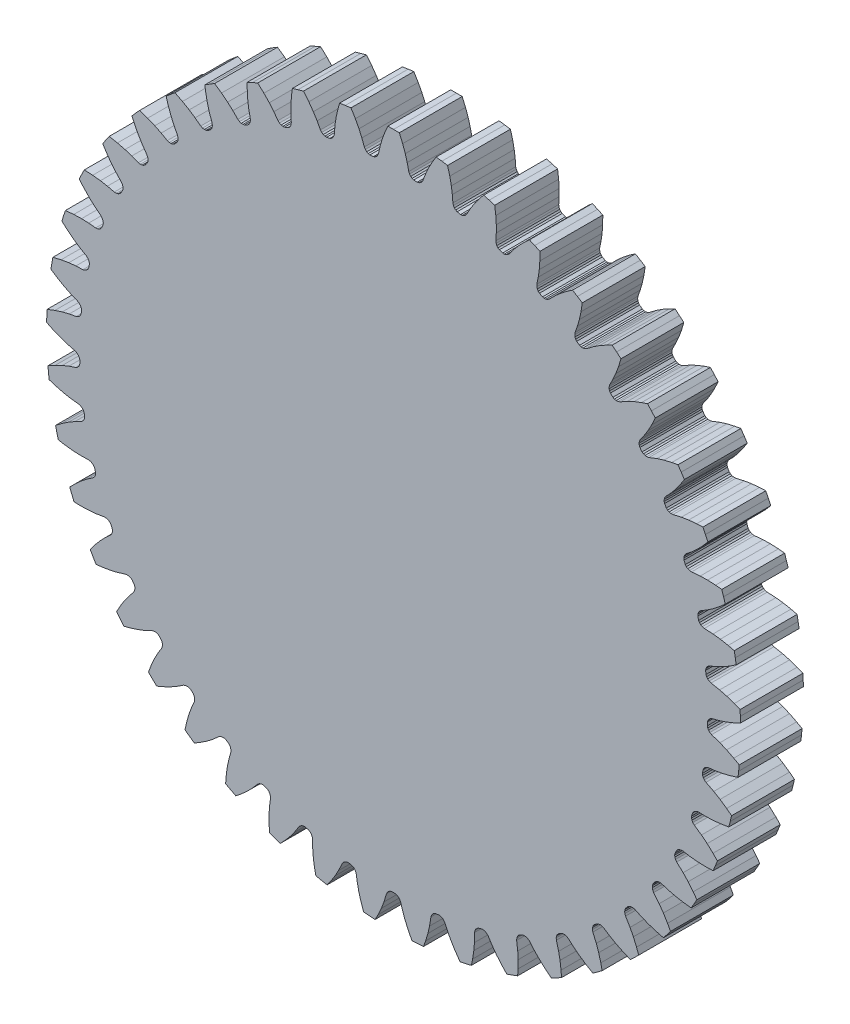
from build123d import *

# Parameters (mm, degrees)
LINEAR_AUSTRAGEN1_DEPTH = 1


with BuildPart() as part:
    # Skizze1 → Linear austragen1 (new body)
    with BuildSketch(Plane.XY):
        Polygon((1.147672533, -5.399374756), (1.058015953, -5.417656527), (0.980703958, -5.308110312), (0.915703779, -5.202894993), (0.862745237, -5.102938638), (0.815981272, -5.000425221), (0.796830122, -4.974771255), (0.774719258, -4.956898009), (0.748999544, -4.945714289), (0.722397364, -4.942161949), (0.667831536, -4.949830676), (0.643239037, -4.960577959), (0.621598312, -4.978417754), (0.604769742, -5.002652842), (0.593531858, -5.033229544), (0.572271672, -5.170171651), (0.546225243, -5.283717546), (0.509782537, -5.405605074), (0.47627831, -5.499414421), (0.385055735, -5.506553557), (0.293727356, -5.512179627), (0.232413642, -5.392939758), (0.182689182, -5.279702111), (0.144157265, -5.17334812), (0.112115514, -5.06532407), (0.096721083, -5.037254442), (0.077312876, -5.0164779), (0.053399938, -5.001823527), (0.027551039, -4.99460345), (-0.027551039, -4.99460345), (-0.053399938, -5.001823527), (-0.077312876, -5.0164779), (-0.097350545, -5.038135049), (-0.112734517, -5.066850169), (-0.152846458, -5.199500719), (-0.194441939, -5.308316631), (-0.247493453, -5.423946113), (-0.293727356, -5.512179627), (-0.385055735, -5.506553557), (-0.47627831, -5.499414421), (-0.520400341, -5.372801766), (-0.553881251, -5.253745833), (-0.577236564, -5.143064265), (-0.593932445, -5.031632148), (-0.605270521, -5.001693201), (-0.621598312, -4.978417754), (-0.643239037, -4.960577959), (-0.667831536, -4.949830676), (-0.722397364, -4.942161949), (-0.748999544, -4.945714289), (-0.774719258, -4.956898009), (-0.797576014, -4.975555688), (-0.816806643, -5.001850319), (-0.874989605, -5.12762742), (-0.93132453, -5.229595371), (-0.999952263, -5.336716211), (-1.058015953, -5.417656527), (-1.147672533, -5.399374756), (-1.237013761, -5.379609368), (-1.263085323, -5.2480883), (-1.279671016, -5.125531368), (-1.287395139, -5.012676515), (-1.288420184, -4.90000523), (-1.295481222, -4.868779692), (-1.308410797, -4.84345837), (-1.327358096, -4.822780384), (-1.35021553, -4.808715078), (-1.403183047, -4.793526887), (-1.430020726, -4.793342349), (-1.45704661, -4.800837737), (-1.482277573, -4.816132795), (-1.504980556, -4.839495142), (-1.580102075, -4.955950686), (-1.650079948, -5.049085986), (-1.732948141, -5.145613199), (-1.801711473, -5.217684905), (-1.887951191, -5.187103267), (-1.973672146, -5.155096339), (-1.981185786, -5.021226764), (-1.980553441, -4.897554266), (-1.972496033, -4.784722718), (-1.95783029, -4.673005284), (-1.960476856, -4.641100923), (-1.969756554, -4.614226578), (-1.98564164, -4.591112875), (-2.006319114, -4.574003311), (-2.056657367, -4.551591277), (-2.083208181, -4.547673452), (-2.111014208, -4.551334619), (-2.138128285, -4.562969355), (-2.163861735, -4.582944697), (-2.254459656, -4.687812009), (-2.336718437, -4.770301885), (-2.432214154, -4.854356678), (-2.510338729, -4.916156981), (-2.591483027, -4.873870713), (-2.671915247, -4.830245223), (-2.660724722, -4.696632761), (-2.642886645, -4.574251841), (-2.619204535, -4.463639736), (-2.589133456, -4.355050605), (-2.587314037, -4.323088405), (-2.59276324, -4.295184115), (-2.605276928, -4.270084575), (-2.623371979, -4.250263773), (-2.670101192, -4.22106412), (-2.695848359, -4.213489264), (-2.723893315, -4.21324495), (-2.752362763, -4.220992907), (-2.780625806, -4.237192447), (-2.884936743, -4.328430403), (-2.97787536, -4.398669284), (-3.084139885, -4.468615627), (-3.170105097, -4.518941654), (-3.244574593, -4.465773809), (-3.318152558, -4.411378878), (-3.288475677, -4.280624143), (-3.253779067, -4.161916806), (-3.2149332, -4.055677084), (-3.170042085, -3.95232982), (-3.163792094, -3.920931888), (-3.165304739, -3.892540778), (-3.174203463, -3.865943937), (-3.189363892, -3.843797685), (-3.231574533, -3.808378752), (-3.256016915, -3.7972943), (-3.283754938, -3.79314926), (-3.313025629, -3.796859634), (-3.343268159, -3.808968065), (-3.459261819, -3.884800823), (-3.561071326, -3.941421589), (-3.676036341, -3.995898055), (-3.768168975, -4.033770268), (-3.834514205, -3.970755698), (-3.899805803, -3.906650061), (-3.852220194, -3.781298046), (-3.801340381, -3.668574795), (-3.748086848, -3.56877529), (-3.68924945, -3.47268143), (-3.678690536, -3.442458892), (-3.676237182, -3.414133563), (-3.681347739, -3.386557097), (-3.693278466, -3.362516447), (-3.730148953, -3.321567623), (-3.752810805, -3.307189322), (-3.779702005, -3.299224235), (-3.809204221, -3.298824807), (-3.8408376, -3.306606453), (-3.966256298, -3.365558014), (-4.074955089, -3.407458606), (-4.196382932, -3.445404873), (-4.292889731, -3.470086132), (-4.34981936, -3.398451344), (-4.405553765, -3.325882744), (-4.340985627, -3.208373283), (-4.274912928, -3.103828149), (-4.208288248, -3.012411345), (-4.136649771, -2.925441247), (-4.121987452, -2.896982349), (-4.115615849, -2.869274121), (-4.116838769, -2.841254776), (-4.125307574, -2.815787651), (-4.156120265, -2.770105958), (-4.176560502, -2.752713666), (-4.202081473, -2.741083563), (-4.231240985, -2.736582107), (-4.263649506, -2.739885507), (-4.396052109, -2.780808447), (-4.509524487, -2.807173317), (-4.635051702, -2.827850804), (-4.73405427, -2.838860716), (-4.780460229, -2.76), (-4.825552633, -2.680380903), (-4.745258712, -2.573001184), (-4.665279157, -2.478669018), (-4.586580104, -2.39741424), (-4.50353491, -2.321260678), (-4.48505457, -2.29511934), (-4.474888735, -2.268567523), (-4.472200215, -2.240650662), (-4.477042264, -2.214252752), (-4.501197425, -2.164727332), (-4.519018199, -2.144659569), (-4.542672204, -2.129590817), (-4.570921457, -2.121074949), (-4.603474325, -2.119835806), (-4.740283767, -2.141933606), (-4.85632112, -2.152249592), (-4.983504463, -2.155255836), (-5.083075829, -2.152380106), (-5.118054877, -2.067828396), (-5.151627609, -1.982708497), (-5.057170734, -1.887548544), (-4.964841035, -1.805265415), (-4.875599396, -1.735754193), (-4.782763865, -1.67189941), (-4.760825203, -1.648584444), (-4.747063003, -1.623705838), (-4.740515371, -1.596434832), (-4.741636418, -1.569619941), (-4.758663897, -1.517214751), (-4.773518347, -1.494862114), (-4.794844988, -1.476648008), (-4.821634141, -1.46428348), (-4.853697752, -1.458525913), (-4.992251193, -1.461368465), (-5.108594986, -1.455434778), (-5.234958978, -1.440711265), (-5.333161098, -1.424005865), (-5.356032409, -1.335408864), (-5.377432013, -1.246444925), (-5.27065068, -1.165356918), (-5.167767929, -1.096724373), (-5.069720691, -1.040309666), (-4.968901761, -0.989996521), (-4.943931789, -0.969961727), (-4.926841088, -0.947240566), (-4.916561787, -0.921146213), (-4.913940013, -0.894436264), (-4.923508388, -0.84017131), (-4.935107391, -0.815968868), (-4.953691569, -0.794963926), (-4.978499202, -0.778991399), (-5.009449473, -0.768827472), (-5.147050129, -0.752359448), (-5.261435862, -0.730291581), (-5.384520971, -0.698124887), (-5.479442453, -0.66791497), (-5.489760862, -0.576997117), (-5.498570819, -0.48592072), (-5.381543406, -0.420482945), (-5.270110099, -0.366836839), (-5.16516564, -0.324616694), (-5.058325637, -0.288824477), (-5.030810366, -0.272459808), (-5.010723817, -0.252338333), (-4.99691292, -0.227928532), (-4.990599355, -0.201843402), (-4.99252239, -0.146774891), (-5.000640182, -0.121193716), (-5.016120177, -0.097806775), (-5.038463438, -0.078537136), (-5.067697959, -0.064164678), (-5.201667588, -0.02870661), (-5.311868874, 0.009065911), (-5.429279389, 0.058049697), (-5.519072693, 0.10117613), (-5.516637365, 0.192645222), (-5.512686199, 0.284061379), (-5.387690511, 0.33257525), (-5.26987557, 0.370190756), (-5.160076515, 0.397394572), (-5.049294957, 0.417969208), (-5.019769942, 0.430345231), (-4.997078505, 0.447475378), (-4.980004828, 0.469725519), (-4.970122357, 0.494678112), (-4.964362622, 0.549478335), (-4.968841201, 0.575940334), (-4.980915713, 0.601254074), (-5.000359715, 0.623445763), (-5.027309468, 0.641747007), (-5.155040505, 0.695504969), (-5.2589124, 0.748246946), (-5.368363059, 0.81309441), (-5.451280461, 0.868297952), (-5.436138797, 0.958537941), (-5.419503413, 1.048514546), (-5.288972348, 1.079160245), (-5.167068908, 1.10001301), (-5.05455237, 1.111671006), (-4.941985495, 1.116627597), (-4.911025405, 1.124774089), (-4.886170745, 1.138579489), (-4.866166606, 1.158236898), (-4.852907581, 1.181571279), (-4.839577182, 1.23503659), (-4.840329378, 1.261864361), (-4.84876339, 1.288612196), (-4.864929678, 1.313293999), (-4.889070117, 1.335167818), (-5.008076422, 1.406179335), (-5.103597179, 1.472864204), (-5.202957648, 1.552313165), (-5.277385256, 1.618519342), (-5.24983197, 1.705773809), (-5.220836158, 1.79255957), (-5.087310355, 1.804740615), (-4.963691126, 1.808424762), (-4.850647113, 1.804310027), (-4.738485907, 1.7935521), (-4.706693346, 1.7973105), (-4.680159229, 1.807522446), (-4.657613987, 1.824204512), (-4.64123648, 1.845466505), (-4.620594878, 1.896556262), (-4.617606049, 1.923227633), (-4.622235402, 1.950888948), (-4.634809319, 1.977580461), (-4.655670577, 2.002601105), (-4.763635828, 2.08948402), (-4.848946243, 2.168813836), (-4.936282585, 2.26131791), (-5.000771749, 2.337238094), (-4.961343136, 2.41980873), (-4.920551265, 2.501714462), (-4.786629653, 2.495193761), (-4.663700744, 2.481637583), (-4.552329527, 2.461830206), (-4.44275708, 2.435567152), (-4.410750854, 2.434864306), (-4.383053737, 2.441284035), (-4.358406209, 2.454666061), (-4.339228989, 2.473441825), (-4.31167795, 2.521161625), (-4.305006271, 2.547157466), (-4.305740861, 2.575193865), (-4.314477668, 2.60337557), (-4.331653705, 2.63105604), (-4.426476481, 2.732119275), (-4.499916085, 2.822549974), (-4.573528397, 2.926308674), (-4.626823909, 3.010465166), (-4.576287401, 3.086744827), (-4.524493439, 3.162176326), (-4.392782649, 3.137080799), (-4.272936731, 3.106548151), (-4.165406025, 3.071433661), (-4.06055504, 3.030176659), (-4.028958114, 3.025026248), (-4.00063709, 3.027528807), (-3.974367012, 3.037350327), (-3.952763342, 3.053274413), (-3.918839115, 3.096695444), (-3.908614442, 3.121509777), (-3.905439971, 3.149375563), (-3.910169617, 3.178498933), (-3.923326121, 3.208300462), (-4.003160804, 3.321576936), (-4.063300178, 3.421348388), (-4.12175568, 3.534342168), (-4.162820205, 3.625096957), (-4.102159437, 3.693600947), (-4.040371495, 3.761090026), (-3.913435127, 3.717908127), (-3.799004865, 3.670993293), (-3.697407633, 3.621255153), (-3.599318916, 3.565807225), (-3.568746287, 3.556309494), (-3.540352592, 3.554846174), (-3.512971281, 3.560916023), (-3.489361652, 3.573678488), (-3.449724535, 3.611955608), (-3.43614588, 3.635105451), (-3.429124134, 3.662258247), (-3.429754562, 3.691756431), (-3.438635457, 3.723098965), (-3.501928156, 3.846383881), (-3.547596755, 3.953554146), (-3.589757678, 4.073583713), (-3.61779194, 4.169170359), (-3.548187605, 4.228565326), (-3.477608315, 4.286798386), (-3.357917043, 4.226370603), (-3.25112969, 4.163986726), (-3.157443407, 4.100593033), (-3.068026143, 4.032033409), (-3.039072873, 4.018373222), (-3.011159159, 4.012972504), (-2.983199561, 4.01517254), (-2.958043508, 4.024524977), (-2.91346499, 4.056913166), (-2.896796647, 4.077947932), (-2.886064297, 4.103859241), (-2.882583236, 4.133158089), (-2.887015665, 4.165431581), (-2.93253446, 4.296325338), (-2.962843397, 4.40880847), (-2.987889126, 4.533537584), (-3.00234747, 4.632095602), (-2.925154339, 4.681225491), (-2.847157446, 4.729069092), (-2.737040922, 4.652571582), (-2.639974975, 4.575932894), (-2.556023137, 4.500117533), (-2.47701773, 4.419780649), (-2.450247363, 4.402223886), (-2.423356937, 4.392990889), (-2.395363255, 4.391278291), (-2.369150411, 4.397038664), (-2.320498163, 4.422907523), (-2.301064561, 4.441417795), (-2.286830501, 4.465583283), (-2.279305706, 4.494112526), (-2.279203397, 4.52668881), (-2.306062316, 4.662643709), (-2.320421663, 4.778250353), (-2.32786471, 4.905251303), (-2.328465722, 5.004862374), (-2.24518627, 5.042770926), (-2.161289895, 5.079293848), (-2.062891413, 4.988215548), (-1.977436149, 4.898813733), (-1.904852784, 4.812052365), (-1.837796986, 4.721501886), (-1.813730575, 4.70039027), (-1.78838683, 4.687504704), (-1.760903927, 4.681912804), (-1.734144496, 4.683968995), (-1.68236548, 4.702815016), (-1.660544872, 4.718440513), (-1.643086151, 4.740389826), (-1.631664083, 4.767594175), (-1.627029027, 4.79983919), (-1.634705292, 4.938209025), (-1.63283556, 5.054689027), (-1.622531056, 5.181489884), (-1.609263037, 5.280215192), (-1.521518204, 5.306164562), (-1.433355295, 5.330655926), (-1.34859007, 5.226769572), (-1.276408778, 5.126344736), (-1.216606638, 5.030326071), (-1.162805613, 4.93132446), (-1.141911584, 4.907068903), (-1.118607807, 4.890781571), (-1.092170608, 4.881419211), (-1.065385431, 4.879731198), (-1.011487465, 4.891187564), (-0.987704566, 4.903624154), (-0.967360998, 4.922930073), (-0.952263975, 4.948280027), (-0.943186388, 4.97956616), (-0.93153059, 5.117657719), (-0.91346817, 5.232743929), (-0.885616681, 5.35687666), (-0.858737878, 5.452794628), (-0.768235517, 5.466279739), (-0.677522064, 5.47826285), (-0.608039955, 5.363590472), (-0.550537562, 5.254097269), (-0.504680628, 5.150690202), (-0.465181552, 5.045164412), (-0.447866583, 5.018237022), (-0.427056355, 4.998864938), (-0.40217943, 4.985914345), (-0.375889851, 4.980514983), (-0.320921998, 4.98435871), (-0.295639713, 4.993364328), (-0.272807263, 5.009651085), (-0.254329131, 5.032653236), (-0.240985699, 5.062371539), (-0.210224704, 5.197497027), (-0.176321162, 5.308949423), (-0.131464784, 5.427997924), (-0.091498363, 5.519241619), (0, 5.52), (0.091498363, 5.519241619), (0.144344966, 5.396015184), (0.186049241, 5.279584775), (0.217068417, 5.170802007), (0.241496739, 5.060805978), (0.254895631, 5.031730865), (0.272807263, 5.009651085), (0.295639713, 4.993364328), (0.320921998, 4.98435871), (0.375889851, 4.980514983), (0.40217943, 4.985914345), (0.427056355, 4.998864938), (0.448555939, 5.019071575), (0.465905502, 5.046643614), (0.515172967, 5.176172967), (0.564257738, 5.281822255), (0.625245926, 5.393469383), (0.677522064, 5.47826285), (0.768235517, 5.466279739), (0.858737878, 5.452794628), (0.893920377, 5.323412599), (0.919014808, 5.202311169), (0.934592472, 5.090270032), (0.943474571, 4.977944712), (0.952696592, 4.947287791), (0.967360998, 4.922930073), (0.987704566, 4.903624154), (1.011487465, 4.891187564), (1.065385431, 4.879731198), (1.092170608, 4.881419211), (1.118607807, 4.890781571), (1.142710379, 4.907799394), (1.163728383, 4.932688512), (1.230543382, 5.054100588), (1.293854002, 5.151890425), (1.369786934, 5.253963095), (1.433355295, 5.330655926), (1.521518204, 5.306164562), (1.609263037, 5.280215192), (1.626096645, 5.147195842), (1.634092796, 5.023780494), (1.633925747, 4.910661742), (1.627088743, 4.798193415), (1.631954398, 4.766551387), (1.643086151, 4.740389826), (1.660544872, 4.718440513), (1.68236548, 4.702815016), (1.734144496, 4.683968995), (1.760903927, 4.681912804), (1.78838683, 4.687504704), (1.81462326, 4.701002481), (1.838900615, 4.722724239), (1.92196267, 4.83365589), (1.99826687, 4.921682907), (2.087666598, 5.012194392), (2.161289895, 5.079293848), (2.24518627, 5.042770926), (2.328465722, 5.004862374), (2.32662279, 4.870794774), (2.317365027, 4.747467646), (2.301456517, 4.635473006), (2.279033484, 4.52505074), (2.279448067, 4.493039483), (2.286830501, 4.465583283), (2.301064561, 4.441417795), (2.320498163, 4.422907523), (2.369150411, 4.397038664), (2.395363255, 4.391278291), (2.423356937, 4.392990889), (2.451216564, 4.402705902), (2.478280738, 4.42083751), (2.57597314, 4.519129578), (2.663785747, 4.595680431), (2.764912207, 4.672869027), (2.847157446, 4.729069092), (2.925154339, 4.681225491), (3.00234747, 4.632095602), (2.98186387, 4.499589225), (2.955532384, 4.37875074), (2.924192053, 4.270060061), (2.88661943, 4.1638331), (2.882574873, 4.132075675), (2.886064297, 4.103859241), (2.896796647, 4.077947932), (2.91346499, 4.056913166), (2.958043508, 4.024524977), (2.983199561, 4.01517254), (3.011159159, 4.012972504), (3.040099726, 4.01871566), (3.069423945, 4.032904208), (3.179845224, 4.11664355), (3.277457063, 4.180228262), (3.388341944, 4.242591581), (3.477608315, 4.286798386), (3.548187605, 4.228565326), (3.61779194, 4.169170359), (3.579066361, 4.040804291), (3.536173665, 3.924806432), (3.490011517, 3.821535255), (3.438020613, 3.721571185), (3.429595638, 3.690685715), (3.429124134, 3.662258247), (3.43614588, 3.635105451), (3.449724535, 3.611955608), (3.489361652, 3.573678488), (3.512971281, 3.560916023), (3.540352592, 3.554846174), (3.569810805, 3.556505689), (3.600824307, 3.566475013), (3.721825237, 3.634031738), (3.827336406, 3.683412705), (3.945821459, 3.729736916), (4.040371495, 3.761090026), (4.102159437, 3.693600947), (4.162820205, 3.625096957), (4.106606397, 3.503369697), (4.047987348, 3.394470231), (3.987901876, 3.298628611), (3.922504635, 3.206873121), (3.909863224, 3.177460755), (3.905439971, 3.149375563), (3.908614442, 3.121509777), (3.918839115, 3.096695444), (3.952763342, 3.053274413), (3.974367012, 3.037350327), (4.00063709, 3.027528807), (4.030039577, 3.025072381), (4.062138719, 3.030628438), (4.191364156, 3.080687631), (4.302721, 3.11490371), (4.426500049, 3.144287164), (4.524493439, 3.162176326), (4.576287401, 3.086744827), (4.626823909, 3.010465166), (4.554216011, 2.897745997), (4.481011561, 2.798064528), (4.408172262, 2.711517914), (4.330641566, 2.629756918), (4.314029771, 2.602390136), (4.305740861, 2.575193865), (4.305006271, 2.547157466), (4.31167795, 2.521161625), (4.339228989, 2.473441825), (4.358406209, 2.454666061), (4.383053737, 2.441284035), (4.411828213, 2.43475948), (4.444388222, 2.435794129), (4.579322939, 2.467381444), (4.694358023, 2.485766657), (4.821021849, 2.49763744), (4.920551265, 2.501714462), (4.961343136, 2.41980873), (5.000771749, 2.337238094), (4.91318299, 2.235720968), (4.826817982, 2.147197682), (4.742642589, 2.071630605), (4.654487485, 2.001455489), (4.634228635, 1.976666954), (4.622235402, 1.950888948), (4.617606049, 1.923227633), (4.620594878, 1.896556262), (4.64123648, 1.845466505), (4.657613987, 1.824204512), (4.680159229, 1.807522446), (4.707745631, 1.797056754), (4.740132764, 1.793549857), (4.878150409, 1.806050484), (4.994624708, 1.808246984), (5.121707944, 1.802374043), (5.220836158, 1.79255957), (5.24983197, 1.705773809), (5.277385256, 1.618519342), (5.176520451, 1.530180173), (5.078675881, 1.454538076), (4.984802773, 1.391421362), (4.8877391, 1.334198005), (4.86422751, 1.312470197), (4.84876339, 1.288612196), (4.840329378, 1.261864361), (4.839577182, 1.23503659), (4.852907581, 1.181571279), (4.866166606, 1.158236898), (4.886170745, 1.138579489), (4.912032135, 1.124376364), (4.943616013, 1.116396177), (5.082030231, 1.109566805), (5.197676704, 1.09553184), (5.322705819, 1.072029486), (5.419503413, 1.048514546), (5.436138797, 0.958537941), (5.451280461, 0.868297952), (5.339102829, 0.794856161), (5.231683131, 0.73356754), (5.12993944, 0.684129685), (5.025856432, 0.640971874), (4.999549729, 0.622727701), (4.980915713, 0.601254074), (4.968841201, 0.575940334), (4.964362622, 0.549478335), (4.970122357, 0.494678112), (4.980004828, 0.469725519), (4.997078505, 0.447475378), (5.020711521, 0.429811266), (5.050877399, 0.417513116), (5.186994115, 0.391486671), (5.299561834, 0.361493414), (5.420103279, 0.320819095), (5.512686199, 0.284061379), (5.516637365, 0.192645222), (5.519072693, 0.10117613), (5.397765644, 0.044061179), (5.28286162, -0.001681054), (5.175227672, -0.036477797), (5.066151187, -0.064730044), (5.0375614, -0.079135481), (5.016120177, -0.097806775), (5.000640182, -0.121193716), (4.99252239, -0.146774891), (4.990599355, -0.201843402), (4.99691292, -0.227928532), (5.010723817, -0.252338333), (5.031668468, -0.273119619), (5.059829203, -0.289496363), (5.190999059, -0.334213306), (5.298297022, -0.379581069), (5.412004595, -0.436635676), (5.498570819, -0.48592072), (5.489760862, -0.576997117), (5.479442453, -0.66791497), (5.351367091, -0.707591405), (5.231215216, -0.736896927), (5.119785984, -0.756375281), (5.00783907, -0.769172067), (4.977522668, -0.779458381), (4.953691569, -0.794963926), (4.935107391, -0.815968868), (4.923508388, -0.84017131), (4.913940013, -0.894436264), (4.916561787, -0.921146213), (4.926841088, -0.947240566), (4.944689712, -0.970734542), (4.970297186, -0.990871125), (5.093967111, -1.053408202), (5.193906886, -1.113267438), (5.298567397, -1.185591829), (5.377432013, -1.246444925), (5.356032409, -1.335408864), (5.333161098, -1.424005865), (5.200810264, -1.445471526), (5.077749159, -1.45776994), (4.964693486, -1.461550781), (4.852055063, -1.45864303), (4.82060212, -1.464610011), (4.794844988, -1.476648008), (4.773518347, -1.494862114), (4.758663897, -1.517214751), (4.741636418, -1.569619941), (4.740515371, -1.596434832), (4.747063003, -1.623705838), (4.761468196, -1.64945522), (4.784023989, -1.672959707), (4.897786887, -1.752099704), (4.988423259, -1.825285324), (5.081999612, -1.911471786), (5.151627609, -1.982708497), (5.118054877, -2.067828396), (5.083075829, -2.152380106), (4.949025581, -2.155217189), (4.82545049, -2.15026912), (4.712968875, -2.138278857), (4.601831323, -2.119723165), (4.569854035, -2.121254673), (4.542672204, -2.129590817), (4.519018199, -2.144659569), (4.501197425, -2.164727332), (4.477042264, -2.214252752), (4.472200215, -2.240650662), (4.474888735, -2.268567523), (4.485570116, -2.296071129), (4.504635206, -2.322486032), (4.606276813, -2.416688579), (4.685845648, -2.501776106), (4.766516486, -2.60014712), (4.825552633, -2.680380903), (4.780460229, -2.76), (4.73405427, -2.838860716), (4.600913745, -2.823014), (4.479229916, -2.800915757), (4.369511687, -2.773387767), (4.262038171, -2.7395453), (4.230158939, -2.736611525), (4.202081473, -2.741083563), (4.176560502, -2.752713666), (4.156120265, -2.770105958), (4.125307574, -2.815787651), (4.116838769, -2.841254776), (4.115615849, -2.869274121), (4.122365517, -2.897996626), (4.137568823, -2.926807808), (4.2251108, -3.03423936), (4.292063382, -3.129572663), (4.358258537, -3.238213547), (4.405553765, -3.325882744), (4.34981936, -3.398451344), (4.292889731, -3.470086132), (4.163250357, -3.435864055), (4.045826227, -3.397045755), (3.941006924, -3.354515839), (3.839289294, -3.306045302), (3.808128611, -3.298703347), (3.779702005, -3.299224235), (3.752810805, -3.307189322), (3.730148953, -3.321567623), (3.693278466, -3.362516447), (3.681347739, -3.386557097), (3.676237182, -3.414133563), (3.678923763, -3.443515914), (3.689969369, -3.474162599), (3.761707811, -3.592732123), (3.814740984, -3.696455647), (3.865172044, -3.81325183), (3.899805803, -3.906650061), (3.834514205, -3.970755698), (3.768168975, -4.033770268), (3.644554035, -3.981838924), (3.533675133, -3.927056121), (3.435794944, -3.870352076), (3.341813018, -3.808196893), (3.311977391, -3.79658966), (3.283754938, -3.79314926), (3.256016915, -3.7972943), (3.231574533, -3.808378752), (3.189363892, -3.843797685), (3.174203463, -3.865943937), (3.165304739, -3.892540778), (3.163875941, -3.922011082), (3.170548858, -3.953896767), (3.225087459, -4.081296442), (3.263168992, -4.191391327), (3.296854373, -4.314069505), (3.318152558, -4.411378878), (3.244574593, -4.465773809), (3.170105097, -4.518941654), (3.054920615, -4.450311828), (2.952745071, -4.380630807), (2.863709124, -4.310856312), (2.779292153, -4.236226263), (2.751362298, -4.220579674), (2.723893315, -4.21324495), (2.695848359, -4.213489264), (2.670101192, -4.22106412), (2.623371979, -4.250263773), (2.605276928, -4.270084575), (2.59276324, -4.295184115), (2.587246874, -4.324168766), (2.589417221, -4.356672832), (2.625694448, -4.490422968), (2.648083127, -4.604746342), (2.664367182, -4.730918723), (2.671915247, -4.830245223), (2.591483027, -4.873870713), (2.510338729, -4.916156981), (2.405826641, -4.832164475), (2.314343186, -4.748941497), (2.235884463, -4.667454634), (2.162675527, -4.581802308), (2.137195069, -4.562420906), (2.111014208, -4.551334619), (2.083208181, -4.547673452), (2.056657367, -4.551591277), (2.006319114, -4.574003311), (1.98564164, -4.591112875), (1.969756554, -4.614226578), (1.960259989, -4.642161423), (1.957885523, -4.674651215), (1.975195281, -4.812148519), (1.981455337, -4.928475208), (1.980021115, -5.055685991), (1.973672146, -5.155096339), (1.887951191, -5.187103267), (1.801711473, -5.217684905), (1.709905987, -5.119964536), (1.630895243, -5.024819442), (1.564540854, -4.93320626), (1.503964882, -4.838198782), (1.481429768, -4.815459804), (1.45704661, -4.800837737), (1.430020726, -4.793342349), (1.403183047, -4.793526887), (1.35021553, -4.808715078), (1.327358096, -4.822780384), (1.308410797, -4.84345837), (1.295118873, -4.869799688), (1.28824581, -4.901642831), (1.286251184, -5.040211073), (1.276260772, -5.156276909), (1.257136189, -5.282050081), (1.237013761, -5.379609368), align=None)
    extrude(amount=LINEAR_AUSTRAGEN1_DEPTH)


solid = part.part
